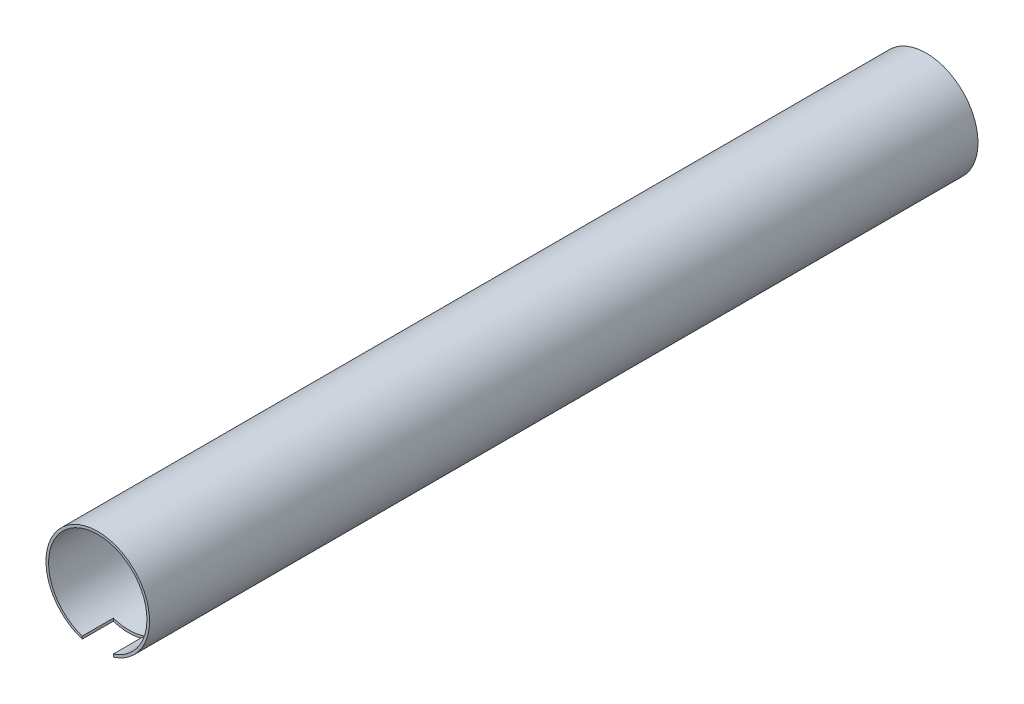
from build123d import *

# Parameters (mm, degrees)
ESQUISSE1_R             = 50
ESQUISSE1_R_2           = 47.5
BOSS_EXTRU_1_DEPTH      = 800
ESQUISSE2_W             = 30
ESQUISSE2_H             = 30
ENL_V_MAT_EXTRU_1_DEPTH = 800


with BuildPart() as part:
    # Esquisse1 → Boss.-Extru.1 (new body)
    with BuildSketch(Plane.XY):
        Circle(ESQUISSE1_R)
        Circle(ESQUISSE1_R_2, mode=Mode.SUBTRACT)
    extrude(amount=BOSS_EXTRU_1_DEPTH)

    # Esquisse2 → Enl_v. mat.-Extru.1 (cut)
    with BuildSketch(Plane(origin=(0, 0, 0), x_dir=(1, 0, 0), z_dir=(0, 1, 0))):
        with Locations((0, -785)):
            Rectangle(ESQUISSE2_W, ESQUISSE2_H)
    extrude(amount=-ENL_V_MAT_EXTRU_1_DEPTH, mode=Mode.SUBTRACT)


solid = part.part
